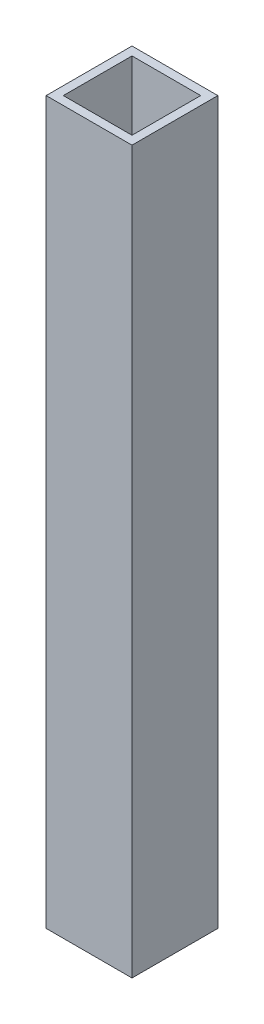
from build123d import *

# Parameters (mm, degrees)
ESQUISSE1_W        = 10
ESQUISSE1_H        = 10
ESQUISSE1_W_2      = 8
ESQUISSE1_H_2      = 8
BOSS_EXTRU_1_DEPTH = 84


with BuildPart() as part:
    # Esquisse1 → Boss.-Extru.1 (new body)
    with BuildSketch(Plane(origin=(0, 0, 0), x_dir=(1, 0, 0), z_dir=(0, 1, 0))):
        Rectangle(ESQUISSE1_W, ESQUISSE1_H)
        Rectangle(ESQUISSE1_W_2, ESQUISSE1_H_2, mode=Mode.SUBTRACT)
    extrude(amount=BOSS_EXTRU_1_DEPTH)


solid = part.part
